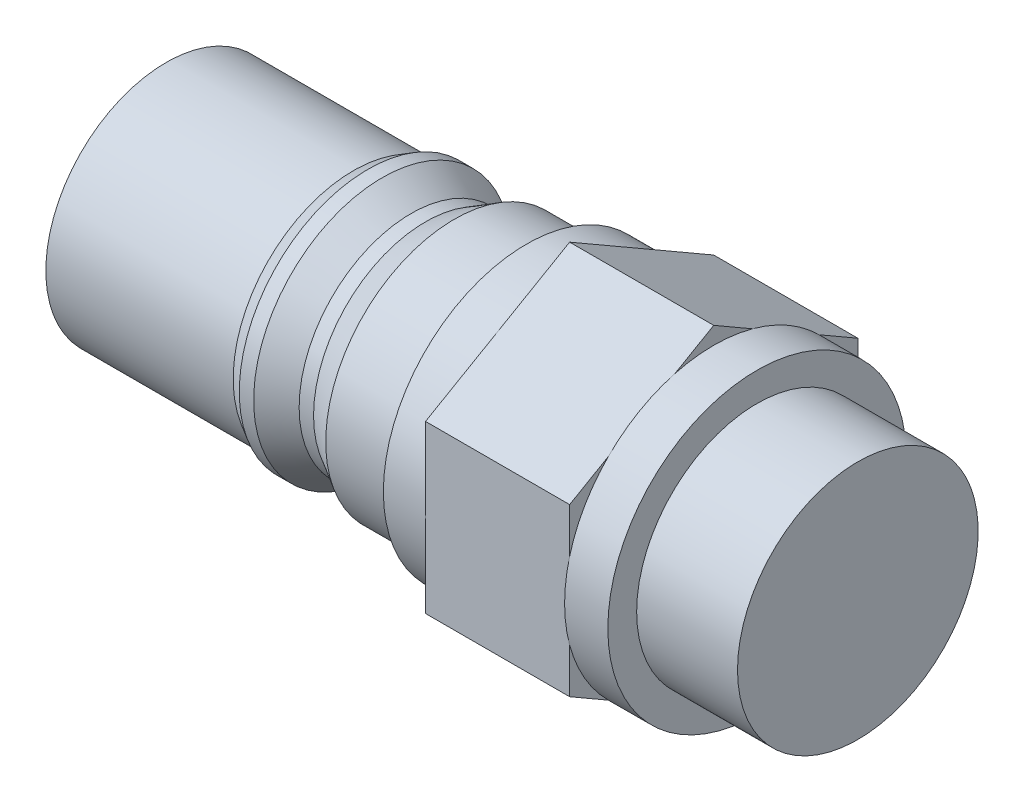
ISO-10303-21;
HEADER;
FILE_DESCRIPTION(('STEP AP214'),'2;1');
FILE_NAME('part.step','',(''),(''),'','','');
FILE_SCHEMA(('AUTOMOTIVE_DESIGN { 1 0 10303 214 1 1 1 1 }'));
ENDSEC;
DATA;
#1=APPLICATION_CONTEXT('core data for automotive mechanical design processes');
#2=APPLICATION_PROTOCOL_DEFINITION('international standard','automotive_design',2000,#1);
#3=PRODUCT_CONTEXT('',#1,'mechanical');
#4=PRODUCT('Part','Part','',(#3));
#5=PRODUCT_RELATED_PRODUCT_CATEGORY('part','',(#4));
#6=PRODUCT_DEFINITION_FORMATION('','',#4);
#7=PRODUCT_DEFINITION_CONTEXT('part definition',#1,'design');
#8=PRODUCT_DEFINITION('design','',#6,#7);
#9=PRODUCT_DEFINITION_SHAPE('','',#8);
#10=(LENGTH_UNIT() NAMED_UNIT(*) SI_UNIT(.MILLI.,.METRE.));
#11=(NAMED_UNIT(*) PLANE_ANGLE_UNIT() SI_UNIT($,.RADIAN.));
#12=(NAMED_UNIT(*) SI_UNIT($,.STERADIAN.) SOLID_ANGLE_UNIT());
#13=UNCERTAINTY_MEASURE_WITH_UNIT(LENGTH_MEASURE(1.E-05),#10,'distance_accuracy_value','');
#14=(GEOMETRIC_REPRESENTATION_CONTEXT(3) GLOBAL_UNCERTAINTY_ASSIGNED_CONTEXT((#13)) GLOBAL_UNIT_ASSIGNED_CONTEXT((#10,
#11,#12)) REPRESENTATION_CONTEXT('',''));
#15=CARTESIAN_POINT('',(0.,0.,0.));
#16=DIRECTION('',(0.,0.,1.));
#17=DIRECTION('',(1.,0.,0.));
#18=AXIS2_PLACEMENT_3D('',#15,#16,#17);
#19=CARTESIAN_POINT('',(38.,0.,0.));
#20=DIRECTION('',(1.,0.,0.));
#21=DIRECTION('',(0.,0.,-1.));
#22=AXIS2_PLACEMENT_3D('',#19,#20,#21);
#23=PLANE('',#22);
#24=DIRECTION('',(0.,-1.,0.));
#25=VECTOR('',#24,1.);
#26=CARTESIAN_POINT('',(38.,5.77350269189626,10.));
#27=LINE('',#26,#25);
#28=CARTESIAN_POINT('',(38.,5.77350269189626,10.));
#29=VERTEX_POINT('',#28);
#30=CARTESIAN_POINT('',(38.,2.6688012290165,10.));
#31=VERTEX_POINT('',#30);
#32=EDGE_CURVE('E122',#29,#31,#27,.T.);
#33=ORIENTED_EDGE('',*,*,#32,.T.);
#34=CARTESIAN_POINT('',(38.,0.,0.));
#35=DIRECTION('',(-1.,0.,0.));
#36=DIRECTION('',(0.,0.,1.));
#37=AXIS2_PLACEMENT_3D('',#34,#35,#36);
#38=CIRCLE('',#37,10.35);
#39=CARTESIAN_POINT('',(38.,7.32585342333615,7.31124966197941));
#40=VERTEX_POINT('',#39);
#41=EDGE_CURVE('E176',#31,#40,#38,.T.);
#42=ORIENTED_EDGE('',*,*,#41,.T.);
#43=DIRECTION('',(0.,-0.5,0.866025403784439));
#44=VECTOR('',#43,1.);
#45=CARTESIAN_POINT('',(38.,11.5470053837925,0.));
#46=LINE('',#45,#44);
#47=EDGE_CURVE('E163',#40,#29,#46,.T.);
#48=ORIENTED_EDGE('',*,*,#47,.T.);
#49=EDGE_LOOP('',(#33,#42,#48));
#50=FACE_BOUND('',#49,.T.);
#51=ADVANCED_FACE('F33',(#50),#23,.T.);
#52=CARTESIAN_POINT('',(38.,11.5470053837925,0.));
#53=VERTEX_POINT('',#52);
#54=CARTESIAN_POINT('',(38.,9.99465465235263,2.6887503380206));
#55=VERTEX_POINT('',#54);
#56=EDGE_CURVE('E160',#53,#55,#46,.T.);
#57=ORIENTED_EDGE('',*,*,#56,.T.);
#58=CARTESIAN_POINT('',(38.,9.99465465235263,-2.6887503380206));
#59=VERTEX_POINT('',#58);
#60=EDGE_CURVE('E11',#55,#59,#38,.T.);
#61=ORIENTED_EDGE('',*,*,#60,.T.);
#62=DIRECTION('',(0.,0.5,0.866025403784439));
#63=VECTOR('',#62,1.);
#64=CARTESIAN_POINT('',(38.,5.77350269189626,-10.));
#65=LINE('',#64,#63);
#66=EDGE_CURVE('E96',#59,#53,#65,.T.);
#67=ORIENTED_EDGE('',*,*,#66,.T.);
#68=EDGE_LOOP('',(#57,#61,#67));
#69=FACE_BOUND('',#68,.T.);
#70=ADVANCED_FACE('F275',(#69),#23,.T.);
#71=CARTESIAN_POINT('',(38.,5.77350269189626,-10.));
#72=VERTEX_POINT('',#71);
#73=CARTESIAN_POINT('',(38.,7.32585342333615,-7.31124966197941));
#74=VERTEX_POINT('',#73);
#75=EDGE_CURVE('E164',#72,#74,#65,.T.);
#76=ORIENTED_EDGE('',*,*,#75,.T.);
#77=CARTESIAN_POINT('',(38.,2.66880122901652,-10.));
#78=VERTEX_POINT('',#77);
#79=EDGE_CURVE('E42',#74,#78,#38,.T.);
#80=ORIENTED_EDGE('',*,*,#79,.T.);
#81=DIRECTION('',(0.,1.,0.));
#82=VECTOR('',#81,1.);
#83=CARTESIAN_POINT('',(38.,-5.77350269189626,-10.));
#84=LINE('',#83,#82);
#85=EDGE_CURVE('E60',#78,#72,#84,.T.);
#86=ORIENTED_EDGE('',*,*,#85,.T.);
#87=EDGE_LOOP('',(#76,#80,#86));
#88=FACE_BOUND('',#87,.T.);
#89=ADVANCED_FACE('F258',(#88),#23,.T.);
#90=CARTESIAN_POINT('',(38.,-5.77350269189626,-10.));
#91=VERTEX_POINT('',#90);
#92=CARTESIAN_POINT('',(38.,-2.66880122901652,-10.));
#93=VERTEX_POINT('',#92);
#94=EDGE_CURVE('E145',#91,#93,#84,.T.);
#95=ORIENTED_EDGE('',*,*,#94,.T.);
#96=CARTESIAN_POINT('',(38.,-7.32585342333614,-7.31124966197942));
#97=VERTEX_POINT('',#96);
#98=EDGE_CURVE('E186',#93,#97,#38,.T.);
#99=ORIENTED_EDGE('',*,*,#98,.T.);
#100=DIRECTION('',(0.,0.5,-0.866025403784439));
#101=VECTOR('',#100,1.);
#102=CARTESIAN_POINT('',(38.,-11.5470053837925,0.));
#103=LINE('',#102,#101);
#104=EDGE_CURVE('E142',#97,#91,#103,.T.);
#105=ORIENTED_EDGE('',*,*,#104,.T.);
#106=EDGE_LOOP('',(#95,#99,#105));
#107=FACE_BOUND('',#106,.T.);
#108=ADVANCED_FACE('F329',(#107),#23,.T.);
#109=CARTESIAN_POINT('',(38.,-11.5470053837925,0.));
#110=VERTEX_POINT('',#109);
#111=CARTESIAN_POINT('',(38.,-9.99465465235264,-2.68875033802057));
#112=VERTEX_POINT('',#111);
#113=EDGE_CURVE('E115',#110,#112,#103,.T.);
#114=ORIENTED_EDGE('',*,*,#113,.T.);
#115=CARTESIAN_POINT('',(38.,-9.99465465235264,2.68875033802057));
#116=VERTEX_POINT('',#115);
#117=EDGE_CURVE('E118',#112,#116,#38,.T.);
#118=ORIENTED_EDGE('',*,*,#117,.T.);
#119=DIRECTION('',(0.,-0.5,-0.866025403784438));
#120=VECTOR('',#119,1.);
#121=CARTESIAN_POINT('',(38.,-5.77350269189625,10.));
#122=LINE('',#121,#120);
#123=EDGE_CURVE('E110',#116,#110,#122,.T.);
#124=ORIENTED_EDGE('',*,*,#123,.T.);
#125=EDGE_LOOP('',(#114,#118,#124));
#126=FACE_BOUND('',#125,.T.);
#127=ADVANCED_FACE('F112',(#126),#23,.T.);
#128=CARTESIAN_POINT('',(0.,0.,0.));
#129=DIRECTION('',(-1.,0.,0.));
#130=DIRECTION('',(0.,0.,1.));
#131=AXIS2_PLACEMENT_3D('',#128,#129,#130);
#132=PLANE('',#131);
#133=CARTESIAN_POINT('',(0.,0.,0.));
#134=DIRECTION('',(1.,0.,0.));
#135=DIRECTION('',(0.,0.,-1.));
#136=AXIS2_PLACEMENT_3D('',#133,#134,#135);
#137=CIRCLE('',#136,8.35);
#138=CARTESIAN_POINT('',(0.,0.,-8.35));
#139=VERTEX_POINT('',#138);
#140=EDGE_CURVE('E37',#139,#139,#137,.T.);
#141=ORIENTED_EDGE('',*,*,#140,.F.);
#142=EDGE_LOOP('',(#141));
#143=FACE_BOUND('',#142,.T.);
#144=ADVANCED_FACE('F35',(#143),#132,.T.);
#145=CARTESIAN_POINT('',(28.,0.,0.));
#146=DIRECTION('',(1.,0.,0.));
#147=DIRECTION('',(0.,0.,-1.));
#148=AXIS2_PLACEMENT_3D('',#145,#146,#147);
#149=CYLINDRICAL_SURFACE('',#148,8.35);
#150=ORIENTED_EDGE('',*,*,#140,.T.);
#151=EDGE_LOOP('',(#150));
#152=FACE_BOUND('',#151,.T.);
#153=CARTESIAN_POINT('',(13.,0.,0.));
#154=DIRECTION('',(1.,0.,0.));
#155=DIRECTION('',(0.,0.,-1.));
#156=AXIS2_PLACEMENT_3D('',#153,#154,#155);
#157=CIRCLE('',#156,8.35);
#158=CARTESIAN_POINT('',(13.,0.,-8.35));
#159=VERTEX_POINT('',#158);
#160=EDGE_CURVE('E188',#159,#159,#157,.T.);
#161=ORIENTED_EDGE('',*,*,#160,.F.);
#162=EDGE_LOOP('',(#161));
#163=FACE_BOUND('',#162,.T.);
#164=ADVANCED_FACE('F334',(#152,#163),#149,.T.);
#165=CARTESIAN_POINT('',(14.,0.,0.));
#166=DIRECTION('',(1.,0.,0.));
#167=DIRECTION('',(0.,0.,-1.));
#168=AXIS2_PLACEMENT_3D('',#165,#166,#167);
#169=CONICAL_SURFACE('',#168,8.92735026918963,0.523598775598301);
#170=ORIENTED_EDGE('',*,*,#160,.T.);
#171=EDGE_LOOP('',(#170));
#172=FACE_BOUND('',#171,.T.);
#173=CARTESIAN_POINT('',(14.,0.,0.));
#174=DIRECTION('',(1.,0.,0.));
#175=DIRECTION('',(0.,0.,-1.));
#176=AXIS2_PLACEMENT_3D('',#173,#174,#175);
#177=CIRCLE('',#176,8.92735026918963);
#178=CARTESIAN_POINT('',(14.,0.,-8.92735026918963));
#179=VERTEX_POINT('',#178);
#180=EDGE_CURVE('E192',#179,#179,#177,.T.);
#181=ORIENTED_EDGE('',*,*,#180,.F.);
#182=EDGE_LOOP('',(#181));
#183=FACE_BOUND('',#182,.T.);
#184=ADVANCED_FACE('F433',(#172,#183),#169,.T.);
#185=CARTESIAN_POINT('',(28.,0.,0.));
#186=DIRECTION('',(1.,0.,0.));
#187=DIRECTION('',(0.,0.,-1.));
#188=AXIS2_PLACEMENT_3D('',#185,#186,#187);
#189=CYLINDRICAL_SURFACE('',#188,8.92735026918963);
#190=ORIENTED_EDGE('',*,*,#180,.T.);
#191=EDGE_LOOP('',(#190));
#192=FACE_BOUND('',#191,.T.);
#193=CARTESIAN_POINT('',(15.,0.,0.));
#194=DIRECTION('',(1.,0.,0.));
#195=DIRECTION('',(0.,0.,-1.));
#196=AXIS2_PLACEMENT_3D('',#193,#194,#195);
#197=CIRCLE('',#196,8.92735026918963);
#198=CARTESIAN_POINT('',(15.,0.,-8.92735026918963));
#199=VERTEX_POINT('',#198);
#200=EDGE_CURVE('E196',#199,#199,#197,.T.);
#201=ORIENTED_EDGE('',*,*,#200,.F.);
#202=EDGE_LOOP('',(#201));
#203=FACE_BOUND('',#202,.T.);
#204=ADVANCED_FACE('F422',(#192,#203),#189,.T.);
#205=CARTESIAN_POINT('',(17.,0.,0.));
#206=DIRECTION('',(-1.,0.,0.));
#207=DIRECTION('',(0.,0.,1.));
#208=AXIS2_PLACEMENT_3D('',#205,#206,#207);
#209=CONICAL_SURFACE('',#208,7.77264973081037,0.523598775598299);
#210=ORIENTED_EDGE('',*,*,#200,.T.);
#211=EDGE_LOOP('',(#210));
#212=FACE_BOUND('',#211,.T.);
#213=CARTESIAN_POINT('',(17.,0.,0.));
#214=DIRECTION('',(1.,0.,0.));
#215=DIRECTION('',(0.,0.,-1.));
#216=AXIS2_PLACEMENT_3D('',#213,#214,#215);
#217=CIRCLE('',#216,7.77264973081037);
#218=CARTESIAN_POINT('',(17.,0.,-7.77264973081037));
#219=VERTEX_POINT('',#218);
#220=EDGE_CURVE('E201',#219,#219,#217,.T.);
#221=ORIENTED_EDGE('',*,*,#220,.F.);
#222=EDGE_LOOP('',(#221));
#223=FACE_BOUND('',#222,.T.);
#224=ADVANCED_FACE('F412',(#212,#223),#209,.T.);
#225=CARTESIAN_POINT('',(28.,0.,0.));
#226=DIRECTION('',(1.,0.,0.));
#227=DIRECTION('',(0.,0.,-1.));
#228=AXIS2_PLACEMENT_3D('',#225,#226,#227);
#229=CYLINDRICAL_SURFACE('',#228,7.77264973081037);
#230=ORIENTED_EDGE('',*,*,#220,.T.);
#231=EDGE_LOOP('',(#230));
#232=FACE_BOUND('',#231,.T.);
#233=CARTESIAN_POINT('',(18.,0.,0.));
#234=DIRECTION('',(1.,0.,0.));
#235=DIRECTION('',(0.,0.,-1.));
#236=AXIS2_PLACEMENT_3D('',#233,#234,#235);
#237=CIRCLE('',#236,7.77264973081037);
#238=CARTESIAN_POINT('',(18.,0.,-7.77264973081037));
#239=VERTEX_POINT('',#238);
#240=EDGE_CURVE('E204',#239,#239,#237,.T.);
#241=ORIENTED_EDGE('',*,*,#240,.F.);
#242=EDGE_LOOP('',(#241));
#243=FACE_BOUND('',#242,.T.);
#244=ADVANCED_FACE('F401',(#232,#243),#229,.T.);
#245=CARTESIAN_POINT('',(20.,0.,0.));
#246=DIRECTION('',(1.,0.,0.));
#247=DIRECTION('',(0.,0.,-1.));
#248=AXIS2_PLACEMENT_3D('',#245,#246,#247);
#249=CONICAL_SURFACE('',#248,8.92735026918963,0.523598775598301);
#250=ORIENTED_EDGE('',*,*,#240,.T.);
#251=EDGE_LOOP('',(#250));
#252=FACE_BOUND('',#251,.T.);
#253=CARTESIAN_POINT('',(20.,0.,0.));
#254=DIRECTION('',(1.,0.,0.));
#255=DIRECTION('',(0.,0.,-1.));
#256=AXIS2_PLACEMENT_3D('',#253,#254,#255);
#257=CIRCLE('',#256,8.92735026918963);
#258=CARTESIAN_POINT('',(20.,0.,-8.92735026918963));
#259=VERTEX_POINT('',#258);
#260=EDGE_CURVE('E207',#259,#259,#257,.T.);
#261=ORIENTED_EDGE('',*,*,#260,.F.);
#262=EDGE_LOOP('',(#261));
#263=FACE_BOUND('',#262,.T.);
#264=ADVANCED_FACE('F391',(#252,#263),#249,.T.);
#265=CARTESIAN_POINT('',(28.,0.,0.));
#266=DIRECTION('',(1.,0.,0.));
#267=DIRECTION('',(0.,0.,-1.));
#268=AXIS2_PLACEMENT_3D('',#265,#266,#267);
#269=CYLINDRICAL_SURFACE('',#268,8.92735026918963);
#270=ORIENTED_EDGE('',*,*,#260,.T.);
#271=EDGE_LOOP('',(#270));
#272=FACE_BOUND('',#271,.T.);
#273=CARTESIAN_POINT('',(25.,0.,0.));
#274=DIRECTION('',(1.,0.,0.));
#275=DIRECTION('',(0.,0.,-1.));
#276=AXIS2_PLACEMENT_3D('',#273,#274,#275);
#277=CIRCLE('',#276,8.92735026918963);
#278=CARTESIAN_POINT('',(25.,0.,-8.92735026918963));
#279=VERTEX_POINT('',#278);
#280=EDGE_CURVE('E210',#279,#279,#277,.T.);
#281=ORIENTED_EDGE('',*,*,#280,.F.);
#282=EDGE_LOOP('',(#281));
#283=FACE_BOUND('',#282,.T.);
#284=ADVANCED_FACE('F381',(#272,#283),#269,.T.);
#285=CARTESIAN_POINT('',(25.,8.92735026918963,0.));
#286=DIRECTION('',(-1.,0.,0.));
#287=DIRECTION('',(0.,0.,1.));
#288=AXIS2_PLACEMENT_3D('',#285,#286,#287);
#289=PLANE('',#288);
#290=ORIENTED_EDGE('',*,*,#280,.T.);
#291=EDGE_LOOP('',(#290));
#292=FACE_BOUND('',#291,.T.);
#293=CARTESIAN_POINT('',(25.,0.,0.));
#294=DIRECTION('',(1.,0.,0.));
#295=DIRECTION('',(0.,0.,-1.));
#296=AXIS2_PLACEMENT_3D('',#293,#294,#295);
#297=CIRCLE('',#296,9.92735026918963);
#298=CARTESIAN_POINT('',(25.,0.,-9.92735026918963));
#299=VERTEX_POINT('',#298);
#300=EDGE_CURVE('E213',#299,#299,#297,.T.);
#301=ORIENTED_EDGE('',*,*,#300,.F.);
#302=EDGE_LOOP('',(#301));
#303=FACE_BOUND('',#302,.T.);
#304=ADVANCED_FACE('F369',(#292,#303),#289,.T.);
#305=CARTESIAN_POINT('',(28.,0.,0.));
#306=DIRECTION('',(1.,0.,0.));
#307=DIRECTION('',(0.,0.,-1.));
#308=AXIS2_PLACEMENT_3D('',#305,#306,#307);
#309=CYLINDRICAL_SURFACE('',#308,9.92735026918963);
#310=ORIENTED_EDGE('',*,*,#300,.T.);
#311=EDGE_LOOP('',(#310));
#312=FACE_BOUND('',#311,.T.);
#313=CARTESIAN_POINT('',(28.,0.,0.));
#314=DIRECTION('',(1.,0.,0.));
#315=DIRECTION('',(0.,0.,-1.));
#316=AXIS2_PLACEMENT_3D('',#313,#314,#315);
#317=CIRCLE('',#316,9.92735026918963);
#318=CARTESIAN_POINT('',(28.,0.,-9.92735026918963));
#319=VERTEX_POINT('',#318);
#320=EDGE_CURVE('E216',#319,#319,#317,.T.);
#321=ORIENTED_EDGE('',*,*,#320,.F.);
#322=EDGE_LOOP('',(#321));
#323=FACE_BOUND('',#322,.T.);
#324=ADVANCED_FACE('F364',(#312,#323),#309,.T.);
#325=CARTESIAN_POINT('',(38.,5.77350269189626,-10.));
#326=DIRECTION('',(0.,-0.866025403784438,0.5));
#327=DIRECTION('',(0.,-0.5,-0.866025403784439));
#328=AXIS2_PLACEMENT_3D('',#325,#326,#327);
#329=PLANE('',#328);
#330=DIRECTION('',(0.,0.5,0.866025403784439));
#331=VECTOR('',#330,1.);
#332=CARTESIAN_POINT('',(28.,5.77350269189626,-10.));
#333=LINE('',#332,#331);
#334=CARTESIAN_POINT('',(28.,5.77350269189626,-10.));
#335=VERTEX_POINT('',#334);
#336=CARTESIAN_POINT('',(28.,11.5470053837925,0.));
#337=VERTEX_POINT('',#336);
#338=EDGE_CURVE('E170',#335,#337,#333,.T.);
#339=ORIENTED_EDGE('',*,*,#338,.T.);
#340=DIRECTION('',(-1.,0.,0.));
#341=VECTOR('',#340,1.);
#342=CARTESIAN_POINT('',(38.,11.5470053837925,0.));
#343=LINE('',#342,#341);
#344=EDGE_CURVE('E219',#53,#337,#343,.T.);
#345=ORIENTED_EDGE('',*,*,#344,.F.);
#346=ORIENTED_EDGE('',*,*,#66,.F.);
#347=EDGE_CURVE('E166',#74,#59,#65,.T.);
#348=ORIENTED_EDGE('',*,*,#347,.F.);
#349=ORIENTED_EDGE('',*,*,#75,.F.);
#350=DIRECTION('',(-1.,0.,0.));
#351=VECTOR('',#350,1.);
#352=CARTESIAN_POINT('',(38.,5.77350269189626,-10.));
#353=LINE('',#352,#351);
#354=EDGE_CURVE('E227',#72,#335,#353,.T.);
#355=ORIENTED_EDGE('',*,*,#354,.T.);
#356=EDGE_LOOP('',(#339,#345,#346,#348,#349,#355));
#357=FACE_BOUND('',#356,.T.);
#358=ADVANCED_FACE('F264',(#357),#329,.F.);
#359=CARTESIAN_POINT('',(38.,11.5470053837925,0.));
#360=DIRECTION('',(0.,-0.866025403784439,-0.5));
#361=DIRECTION('',(0.,0.5,-0.866025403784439));
#362=AXIS2_PLACEMENT_3D('',#359,#360,#361);
#363=PLANE('',#362);
#364=DIRECTION('',(0.,-0.5,0.866025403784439));
#365=VECTOR('',#364,1.);
#366=CARTESIAN_POINT('',(28.,11.5470053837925,0.));
#367=LINE('',#366,#365);
#368=CARTESIAN_POINT('',(28.,5.77350269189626,10.));
#369=VERTEX_POINT('',#368);
#370=EDGE_CURVE('E235',#337,#369,#367,.T.);
#371=ORIENTED_EDGE('',*,*,#370,.T.);
#372=DIRECTION('',(-1.,0.,0.));
#373=VECTOR('',#372,1.);
#374=CARTESIAN_POINT('',(38.,5.77350269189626,10.));
#375=LINE('',#374,#373);
#376=EDGE_CURVE('E222',#29,#369,#375,.T.);
#377=ORIENTED_EDGE('',*,*,#376,.F.);
#378=ORIENTED_EDGE('',*,*,#47,.F.);
#379=EDGE_CURVE('E162',#55,#40,#46,.T.);
#380=ORIENTED_EDGE('',*,*,#379,.F.);
#381=ORIENTED_EDGE('',*,*,#56,.F.);
#382=ORIENTED_EDGE('',*,*,#344,.T.);
#383=EDGE_LOOP('',(#371,#377,#378,#380,#381,#382));
#384=FACE_BOUND('',#383,.T.);
#385=ADVANCED_FACE('F279',(#384),#363,.F.);
#386=CARTESIAN_POINT('',(38.,5.77350269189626,10.));
#387=DIRECTION('',(0.,0.,-1.));
#388=DIRECTION('',(-1.,0.,0.));
#389=AXIS2_PLACEMENT_3D('',#386,#387,#388);
#390=PLANE('',#389);
#391=DIRECTION('',(0.,-1.,0.));
#392=VECTOR('',#391,1.);
#393=CARTESIAN_POINT('',(28.,5.77350269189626,10.));
#394=LINE('',#393,#392);
#395=CARTESIAN_POINT('',(28.,-5.77350269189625,10.));
#396=VERTEX_POINT('',#395);
#397=EDGE_CURVE('E233',#369,#396,#394,.T.);
#398=ORIENTED_EDGE('',*,*,#397,.T.);
#399=DIRECTION('',(-1.,0.,0.));
#400=VECTOR('',#399,1.);
#401=CARTESIAN_POINT('',(38.,-5.77350269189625,10.));
#402=LINE('',#401,#400);
#403=CARTESIAN_POINT('',(38.,-5.77350269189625,10.));
#404=VERTEX_POINT('',#403);
#405=EDGE_CURVE('E133',#404,#396,#402,.T.);
#406=ORIENTED_EDGE('',*,*,#405,.F.);
#407=CARTESIAN_POINT('',(38.,-2.6688012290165,10.));
#408=VERTEX_POINT('',#407);
#409=EDGE_CURVE('E159',#408,#404,#27,.T.);
#410=ORIENTED_EDGE('',*,*,#409,.F.);
#411=EDGE_CURVE('E158',#31,#408,#27,.T.);
#412=ORIENTED_EDGE('',*,*,#411,.F.);
#413=ORIENTED_EDGE('',*,*,#32,.F.);
#414=ORIENTED_EDGE('',*,*,#376,.T.);
#415=EDGE_LOOP('',(#398,#406,#410,#412,#413,#414));
#416=FACE_BOUND('',#415,.T.);
#417=ADVANCED_FACE('F287',(#416),#390,.F.);
#418=CARTESIAN_POINT('',(38.,-5.77350269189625,10.));
#419=DIRECTION('',(0.,0.866025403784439,-0.5));
#420=DIRECTION('',(0.,0.5,0.866025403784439));
#421=AXIS2_PLACEMENT_3D('',#418,#419,#420);
#422=PLANE('',#421);
#423=DIRECTION('',(0.,-0.5,-0.866025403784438));
#424=VECTOR('',#423,1.);
#425=CARTESIAN_POINT('',(28.,-5.77350269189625,10.));
#426=LINE('',#425,#424);
#427=CARTESIAN_POINT('',(28.,-11.5470053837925,0.));
#428=VERTEX_POINT('',#427);
#429=EDGE_CURVE('E130',#396,#428,#426,.T.);
#430=ORIENTED_EDGE('',*,*,#429,.T.);
#431=DIRECTION('',(-1.,0.,0.));
#432=VECTOR('',#431,1.);
#433=CARTESIAN_POINT('',(38.,-11.5470053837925,0.));
#434=LINE('',#433,#432);
#435=EDGE_CURVE('E126',#110,#428,#434,.T.);
#436=ORIENTED_EDGE('',*,*,#435,.F.);
#437=ORIENTED_EDGE('',*,*,#123,.F.);
#438=CARTESIAN_POINT('',(38.,-7.32585342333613,7.31124966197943));
#439=VERTEX_POINT('',#438);
#440=EDGE_CURVE('E121',#439,#116,#122,.T.);
#441=ORIENTED_EDGE('',*,*,#440,.F.);
#442=EDGE_CURVE('E124',#404,#439,#122,.T.);
#443=ORIENTED_EDGE('',*,*,#442,.F.);
#444=ORIENTED_EDGE('',*,*,#405,.T.);
#445=EDGE_LOOP('',(#430,#436,#437,#441,#443,#444));
#446=FACE_BOUND('',#445,.T.);
#447=ADVANCED_FACE('F127',(#446),#422,.F.);
#448=CARTESIAN_POINT('',(38.,-11.5470053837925,0.));
#449=DIRECTION('',(0.,0.866025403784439,0.5));
#450=DIRECTION('',(0.,-0.5,0.866025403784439));
#451=AXIS2_PLACEMENT_3D('',#448,#449,#450);
#452=PLANE('',#451);
#453=DIRECTION('',(0.,0.5,-0.866025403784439));
#454=VECTOR('',#453,1.);
#455=CARTESIAN_POINT('',(28.,-11.5470053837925,0.));
#456=LINE('',#455,#454);
#457=CARTESIAN_POINT('',(28.,-5.77350269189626,-10.));
#458=VERTEX_POINT('',#457);
#459=EDGE_CURVE('E230',#428,#458,#456,.T.);
#460=ORIENTED_EDGE('',*,*,#459,.T.);
#461=DIRECTION('',(-1.,0.,0.));
#462=VECTOR('',#461,1.);
#463=CARTESIAN_POINT('',(38.,-5.77350269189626,-10.));
#464=LINE('',#463,#462);
#465=EDGE_CURVE('E134',#91,#458,#464,.T.);
#466=ORIENTED_EDGE('',*,*,#465,.F.);
#467=ORIENTED_EDGE('',*,*,#104,.F.);
#468=EDGE_CURVE('E140',#112,#97,#103,.T.);
#469=ORIENTED_EDGE('',*,*,#468,.F.);
#470=ORIENTED_EDGE('',*,*,#113,.F.);
#471=ORIENTED_EDGE('',*,*,#435,.T.);
#472=EDGE_LOOP('',(#460,#466,#467,#469,#470,#471));
#473=FACE_BOUND('',#472,.T.);
#474=ADVANCED_FACE('F137',(#473),#452,.F.);
#475=CARTESIAN_POINT('',(38.,-5.77350269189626,-10.));
#476=DIRECTION('',(0.,0.,1.));
#477=DIRECTION('',(1.,0.,0.));
#478=AXIS2_PLACEMENT_3D('',#475,#476,#477);
#479=PLANE('',#478);
#480=DIRECTION('',(0.,1.,0.));
#481=VECTOR('',#480,1.);
#482=CARTESIAN_POINT('',(28.,-5.77350269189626,-10.));
#483=LINE('',#482,#481);
#484=EDGE_CURVE('E88',#458,#335,#483,.T.);
#485=ORIENTED_EDGE('',*,*,#484,.T.);
#486=ORIENTED_EDGE('',*,*,#354,.F.);
#487=ORIENTED_EDGE('',*,*,#85,.F.);
#488=EDGE_CURVE('E143',#93,#78,#84,.T.);
#489=ORIENTED_EDGE('',*,*,#488,.F.);
#490=ORIENTED_EDGE('',*,*,#94,.F.);
#491=ORIENTED_EDGE('',*,*,#465,.T.);
#492=EDGE_LOOP('',(#485,#486,#487,#489,#490,#491));
#493=FACE_BOUND('',#492,.T.);
#494=ADVANCED_FACE('F260',(#493),#479,.F.);
#495=ORIENTED_EDGE('',*,*,#442,.T.);
#496=EDGE_CURVE('E178',#439,#408,#38,.T.);
#497=ORIENTED_EDGE('',*,*,#496,.T.);
#498=ORIENTED_EDGE('',*,*,#409,.T.);
#499=EDGE_LOOP('',(#495,#497,#498));
#500=FACE_BOUND('',#499,.T.);
#501=ADVANCED_FACE('F315',(#500),#23,.T.);
#502=CARTESIAN_POINT('',(28.,0.,0.));
#503=DIRECTION('',(1.,0.,0.));
#504=DIRECTION('',(0.,0.,-1.));
#505=AXIS2_PLACEMENT_3D('',#502,#503,#504);
#506=PLANE('',#505);
#507=ORIENTED_EDGE('',*,*,#320,.T.);
#508=EDGE_LOOP('',(#507));
#509=FACE_BOUND('',#508,.T.);
#510=ORIENTED_EDGE('',*,*,#338,.F.);
#511=ORIENTED_EDGE('',*,*,#484,.F.);
#512=ORIENTED_EDGE('',*,*,#459,.F.);
#513=ORIENTED_EDGE('',*,*,#429,.F.);
#514=ORIENTED_EDGE('',*,*,#397,.F.);
#515=ORIENTED_EDGE('',*,*,#370,.F.);
#516=EDGE_LOOP('',(#510,#511,#512,#513,#514,#515));
#517=FACE_BOUND('',#516,.T.);
#518=ADVANCED_FACE('F282',(#509,#517),#506,.F.);
#519=CARTESIAN_POINT('',(38.,10.35,0.));
#520=DIRECTION('',(1.,0.,0.));
#521=DIRECTION('',(0.,0.,-1.));
#522=AXIS2_PLACEMENT_3D('',#519,#520,#521);
#523=PLANE('',#522);
#524=EDGE_CURVE('E183',#59,#74,#38,.T.);
#525=ORIENTED_EDGE('',*,*,#524,.T.);
#526=ORIENTED_EDGE('',*,*,#347,.T.);
#527=EDGE_LOOP('',(#525,#526));
#528=FACE_BOUND('',#527,.T.);
#529=ADVANCED_FACE('F270',(#528),#523,.F.);
#530=EDGE_CURVE('E44',#40,#55,#38,.T.);
#531=ORIENTED_EDGE('',*,*,#530,.T.);
#532=ORIENTED_EDGE('',*,*,#379,.T.);
#533=EDGE_LOOP('',(#531,#532));
#534=FACE_BOUND('',#533,.T.);
#535=ADVANCED_FACE('F304',(#534),#523,.F.);
#536=EDGE_CURVE('E51',#408,#31,#38,.T.);
#537=ORIENTED_EDGE('',*,*,#536,.T.);
#538=ORIENTED_EDGE('',*,*,#411,.T.);
#539=EDGE_LOOP('',(#537,#538));
#540=FACE_BOUND('',#539,.T.);
#541=ADVANCED_FACE('F302',(#540),#523,.F.);
#542=EDGE_CURVE('E184',#116,#439,#38,.T.);
#543=ORIENTED_EDGE('',*,*,#542,.T.);
#544=ORIENTED_EDGE('',*,*,#440,.T.);
#545=EDGE_LOOP('',(#543,#544));
#546=FACE_BOUND('',#545,.T.);
#547=ADVANCED_FACE('F301',(#546),#523,.F.);
#548=EDGE_CURVE('E257',#97,#112,#38,.T.);
#549=ORIENTED_EDGE('',*,*,#548,.T.);
#550=ORIENTED_EDGE('',*,*,#468,.T.);
#551=EDGE_LOOP('',(#549,#550));
#552=FACE_BOUND('',#551,.T.);
#553=ADVANCED_FACE('F310',(#552),#523,.F.);
#554=EDGE_CURVE('E247',#78,#93,#38,.T.);
#555=ORIENTED_EDGE('',*,*,#554,.T.);
#556=ORIENTED_EDGE('',*,*,#488,.T.);
#557=EDGE_LOOP('',(#555,#556));
#558=FACE_BOUND('',#557,.T.);
#559=ADVANCED_FACE('F246',(#558),#523,.F.);
#560=CARTESIAN_POINT('',(48.,0.,0.));
#561=DIRECTION('',(-1.,0.,0.));
#562=DIRECTION('',(0.,0.,1.));
#563=AXIS2_PLACEMENT_3D('',#560,#561,#562);
#564=PLANE('',#563);
#565=CARTESIAN_POINT('',(48.,0.,0.));
#566=DIRECTION('',(-1.,0.,0.));
#567=DIRECTION('',(0.,0.,1.));
#568=AXIS2_PLACEMENT_3D('',#565,#566,#567);
#569=CIRCLE('',#568,8.35);
#570=CARTESIAN_POINT('',(48.,0.,8.35));
#571=VERTEX_POINT('',#570);
#572=EDGE_CURVE('E167',#571,#571,#569,.T.);
#573=ORIENTED_EDGE('',*,*,#572,.F.);
#574=EDGE_LOOP('',(#573));
#575=FACE_BOUND('',#574,.T.);
#576=ADVANCED_FACE('F518',(#575),#564,.F.);
#577=CARTESIAN_POINT('',(38.,0.,0.));
#578=DIRECTION('',(-1.,0.,0.));
#579=DIRECTION('',(0.,0.,1.));
#580=AXIS2_PLACEMENT_3D('',#577,#578,#579);
#581=CYLINDRICAL_SURFACE('',#580,8.35);
#582=CARTESIAN_POINT('',(41.,0.,0.));
#583=DIRECTION('',(-1.,0.,0.));
#584=DIRECTION('',(0.,0.,1.));
#585=AXIS2_PLACEMENT_3D('',#582,#583,#584);
#586=CIRCLE('',#585,8.35);
#587=CARTESIAN_POINT('',(41.,0.,8.35));
#588=VERTEX_POINT('',#587);
#589=EDGE_CURVE('E171',#588,#588,#586,.T.);
#590=ORIENTED_EDGE('',*,*,#589,.F.);
#591=EDGE_LOOP('',(#590));
#592=FACE_BOUND('',#591,.T.);
#593=ORIENTED_EDGE('',*,*,#572,.T.);
#594=EDGE_LOOP('',(#593));
#595=FACE_BOUND('',#594,.T.);
#596=ADVANCED_FACE('F526',(#592,#595),#581,.T.);
#597=CARTESIAN_POINT('',(41.,8.35,0.));
#598=DIRECTION('',(-1.,0.,0.));
#599=DIRECTION('',(0.,0.,1.));
#600=AXIS2_PLACEMENT_3D('',#597,#598,#599);
#601=PLANE('',#600);
#602=CARTESIAN_POINT('',(41.,0.,0.));
#603=DIRECTION('',(-1.,0.,0.));
#604=DIRECTION('',(0.,0.,1.));
#605=AXIS2_PLACEMENT_3D('',#602,#603,#604);
#606=CIRCLE('',#605,10.35);
#607=CARTESIAN_POINT('',(41.,0.,10.35));
#608=VERTEX_POINT('',#607);
#609=EDGE_CURVE('E174',#608,#608,#606,.T.);
#610=ORIENTED_EDGE('',*,*,#609,.F.);
#611=EDGE_LOOP('',(#610));
#612=FACE_BOUND('',#611,.T.);
#613=ORIENTED_EDGE('',*,*,#589,.T.);
#614=EDGE_LOOP('',(#613));
#615=FACE_BOUND('',#614,.T.);
#616=ADVANCED_FACE('F535',(#612,#615),#601,.F.);
#617=CARTESIAN_POINT('',(38.,0.,0.));
#618=DIRECTION('',(-1.,0.,0.));
#619=DIRECTION('',(0.,0.,1.));
#620=AXIS2_PLACEMENT_3D('',#617,#618,#619);
#621=CYLINDRICAL_SURFACE('',#620,10.35);
#622=ORIENTED_EDGE('',*,*,#41,.F.);
#623=ORIENTED_EDGE('',*,*,#536,.F.);
#624=ORIENTED_EDGE('',*,*,#496,.F.);
#625=ORIENTED_EDGE('',*,*,#542,.F.);
#626=ORIENTED_EDGE('',*,*,#117,.F.);
#627=ORIENTED_EDGE('',*,*,#548,.F.);
#628=ORIENTED_EDGE('',*,*,#98,.F.);
#629=ORIENTED_EDGE('',*,*,#554,.F.);
#630=ORIENTED_EDGE('',*,*,#79,.F.);
#631=ORIENTED_EDGE('',*,*,#524,.F.);
#632=ORIENTED_EDGE('',*,*,#60,.F.);
#633=ORIENTED_EDGE('',*,*,#530,.F.);
#634=EDGE_LOOP('',(#622,#623,#624,#625,#626,#627,#628,#629,#630,#631,#632,#633));
#635=FACE_BOUND('',#634,.T.);
#636=ORIENTED_EDGE('',*,*,#609,.T.);
#637=EDGE_LOOP('',(#636));
#638=FACE_BOUND('',#637,.T.);
#639=ADVANCED_FACE('F252',(#635,#638),#621,.T.);
#640=CLOSED_SHELL('',(#51,#70,#89,#108,#127,#144,#164,#184,#204,#224,#244,#264,#284,#304,#324,
#358,#385,#417,#447,#474,#494,#501,#518,#529,#535,#541,#547,#553,#559,#576,#596,#616,#639));
#641=MANIFOLD_SOLID_BREP('B2',#640);
#642=ADVANCED_BREP_SHAPE_REPRESENTATION('',(#18,#641),#14);
#643=SHAPE_DEFINITION_REPRESENTATION(#9,#642);
ENDSEC;
END-ISO-10303-21;
